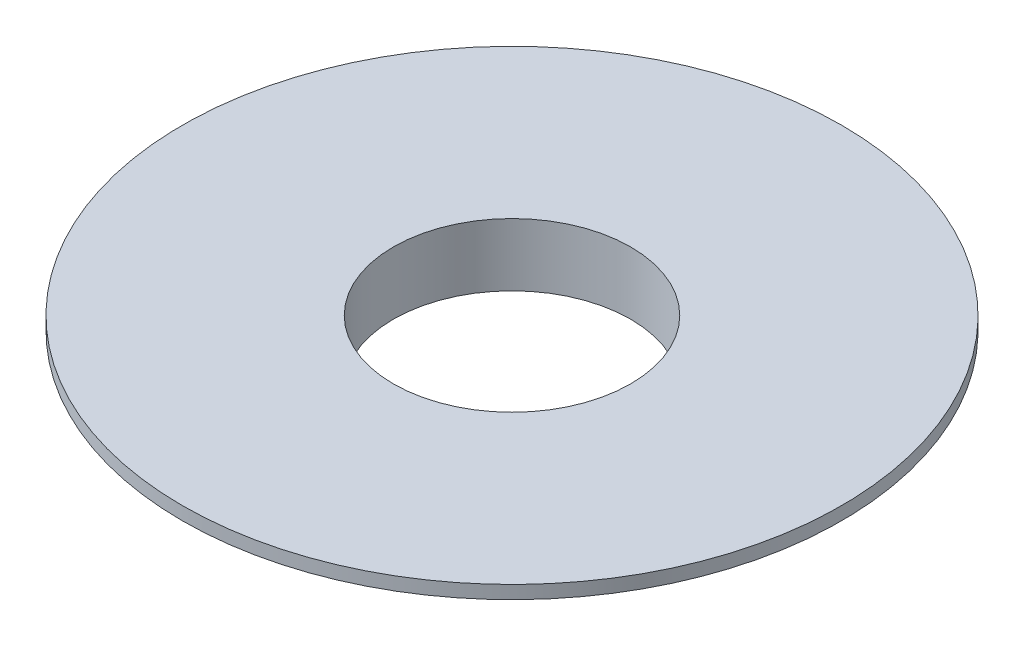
from build123d import *


with BuildPart() as part:
    # Esquisse1 → R_volution1 (revolve)
    with BuildSketch(Plane(origin=(0, 0, 0), x_dir=(-1, 0, 0), z_dir=(0, 0, -1)), mode=Mode.PRIVATE) as r_volution1_sk:
        Polygon((-22, -6.837481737), (-22, -14.337481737), (-18, -14.337481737), (-18, -4.837481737), (-50, -4.837481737), (-50, -6.837481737), align=None)
    revolve(r_volution1_sk.sketch.rotate(Axis((0, -14.337481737, 0), (0, 1, 0)), 270), axis=Axis((0, -14.337481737, 0), (0, 1, 0)))


solid = part.part
